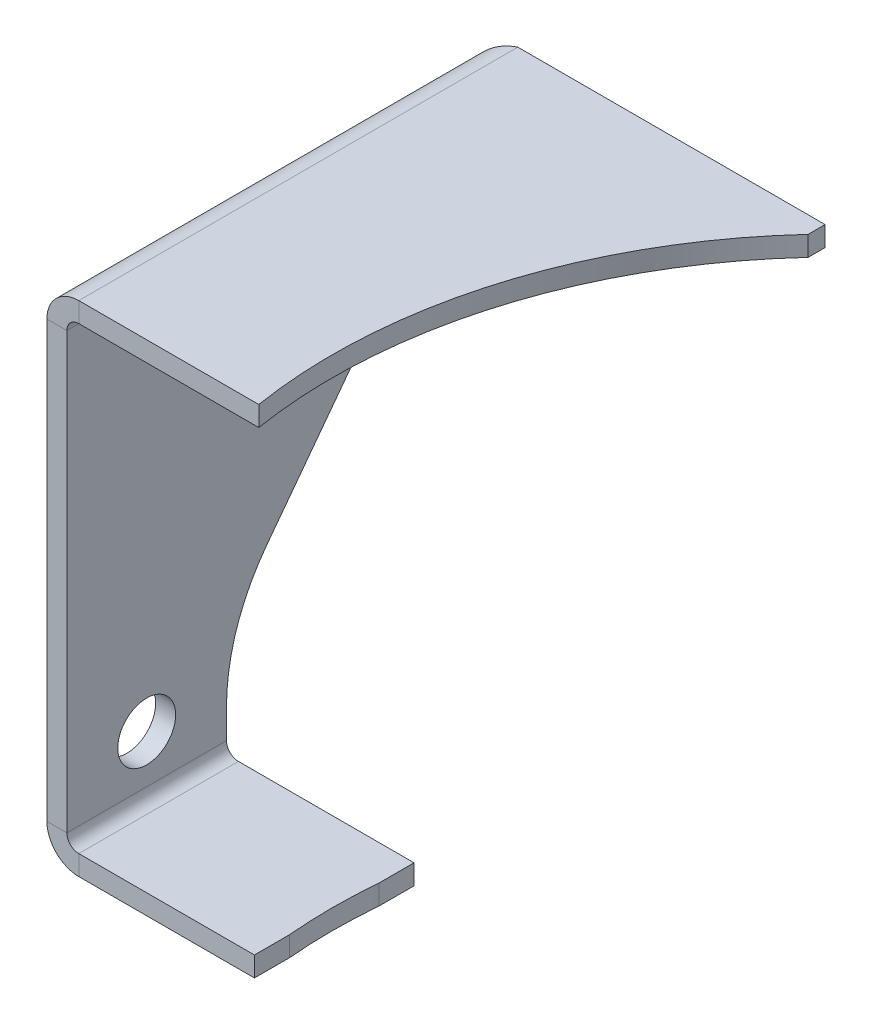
ISO-10303-21;
HEADER;
FILE_DESCRIPTION(('STEP AP214'),'2;1');
FILE_NAME('part.step','',(''),(''),'','','');
FILE_SCHEMA(('AUTOMOTIVE_DESIGN { 1 0 10303 214 1 1 1 1 }'));
ENDSEC;
DATA;
#1=APPLICATION_CONTEXT('core data for automotive mechanical design processes');
#2=APPLICATION_PROTOCOL_DEFINITION('international standard','automotive_design',2000,#1);
#3=PRODUCT_CONTEXT('',#1,'mechanical');
#4=PRODUCT('Part','Part','',(#3));
#5=PRODUCT_RELATED_PRODUCT_CATEGORY('part','',(#4));
#6=PRODUCT_DEFINITION_FORMATION('','',#4);
#7=PRODUCT_DEFINITION_CONTEXT('part definition',#1,'design');
#8=PRODUCT_DEFINITION('design','',#6,#7);
#9=PRODUCT_DEFINITION_SHAPE('','',#8);
#10=(LENGTH_UNIT() NAMED_UNIT(*) SI_UNIT(.MILLI.,.METRE.));
#11=(NAMED_UNIT(*) PLANE_ANGLE_UNIT() SI_UNIT($,.RADIAN.));
#12=(NAMED_UNIT(*) SI_UNIT($,.STERADIAN.) SOLID_ANGLE_UNIT());
#13=UNCERTAINTY_MEASURE_WITH_UNIT(LENGTH_MEASURE(1.E-05),#10,'distance_accuracy_value','');
#14=(GEOMETRIC_REPRESENTATION_CONTEXT(3) GLOBAL_UNCERTAINTY_ASSIGNED_CONTEXT((#13)) GLOBAL_UNIT_ASSIGNED_CONTEXT((#10,
#11,#12)) REPRESENTATION_CONTEXT('',''));
#15=CARTESIAN_POINT('',(0.,0.,0.));
#16=DIRECTION('',(0.,0.,1.));
#17=DIRECTION('',(1.,0.,0.));
#18=AXIS2_PLACEMENT_3D('',#15,#16,#17);
#19=CARTESIAN_POINT('',(0.,-20.,20.));
#20=DIRECTION('',(0.,1.,0.));
#21=DIRECTION('',(0.,0.,1.));
#22=AXIS2_PLACEMENT_3D('',#19,#20,#21);
#23=PLANE('',#22);
#24=CARTESIAN_POINT('',(178.,-20.,0.));
#25=DIRECTION('',(0.,1.,0.));
#26=DIRECTION('',(0.,0.,1.));
#27=AXIS2_PLACEMENT_3D('',#24,#25,#26);
#28=CIRCLE('',#27,126.5);
#29=CARTESIAN_POINT('',(52.,-20.,-11.236102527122));
#30=VERTEX_POINT('',#29);
#31=CARTESIAN_POINT('',(52.,-20.,11.236102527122));
#32=VERTEX_POINT('',#31);
#33=EDGE_CURVE('E183',#30,#32,#28,.T.);
#34=ORIENTED_EDGE('',*,*,#33,.T.);
#35=DIRECTION('',(0.,0.,-1.));
#36=VECTOR('',#35,1.);
#37=CARTESIAN_POINT('',(52.,-20.,20.));
#38=LINE('',#37,#36);
#39=CARTESIAN_POINT('',(52.,-20.,20.));
#40=VERTEX_POINT('',#39);
#41=EDGE_CURVE('E192',#40,#32,#38,.T.);
#42=ORIENTED_EDGE('',*,*,#41,.F.);
#43=DIRECTION('',(1.,0.,0.));
#44=VECTOR('',#43,1.);
#45=CARTESIAN_POINT('',(0.,-20.,20.));
#46=LINE('',#45,#44);
#47=CARTESIAN_POINT('',(8.,-20.,20.));
#48=VERTEX_POINT('',#47);
#49=EDGE_CURVE('E246',#48,#40,#46,.T.);
#50=ORIENTED_EDGE('',*,*,#49,.F.);
#51=DIRECTION('',(0.,0.,-1.));
#52=VECTOR('',#51,1.);
#53=CARTESIAN_POINT('',(8.,-20.,20.));
#54=LINE('',#53,#52);
#55=CARTESIAN_POINT('',(8.,-20.,-20.));
#56=VERTEX_POINT('',#55);
#57=EDGE_CURVE('E247',#48,#56,#54,.T.);
#58=ORIENTED_EDGE('',*,*,#57,.T.);
#59=DIRECTION('',(1.,0.,0.));
#60=VECTOR('',#59,1.);
#61=CARTESIAN_POINT('',(0.,-20.,-20.));
#62=LINE('',#61,#60);
#63=CARTESIAN_POINT('',(52.,-20.,-20.));
#64=VERTEX_POINT('',#63);
#65=EDGE_CURVE('E614',#56,#64,#62,.T.);
#66=ORIENTED_EDGE('',*,*,#65,.T.);
#67=EDGE_CURVE('E200',#30,#64,#38,.T.);
#68=ORIENTED_EDGE('',*,*,#67,.F.);
#69=EDGE_LOOP('',(#34,#42,#50,#58,#66,#68));
#70=FACE_BOUND('',#69,.T.);
#71=ADVANCED_FACE('F56',(#70),#23,.F.);
#72=CARTESIAN_POINT('',(52.,-15.,20.));
#73=DIRECTION('',(1.,0.,0.));
#74=DIRECTION('',(0.,0.,-1.));
#75=AXIS2_PLACEMENT_3D('',#72,#73,#74);
#76=PLANE('',#75);
#77=DIRECTION('',(0.,0.,-1.));
#78=VECTOR('',#77,1.);
#79=CARTESIAN_POINT('',(52.,-15.,20.));
#80=LINE('',#79,#78);
#81=CARTESIAN_POINT('',(52.,-15.,-11.236102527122));
#82=VERTEX_POINT('',#81);
#83=CARTESIAN_POINT('',(52.,-15.,-20.));
#84=VERTEX_POINT('',#83);
#85=EDGE_CURVE('E201',#82,#84,#80,.T.);
#86=ORIENTED_EDGE('',*,*,#85,.F.);
#87=DIRECTION('',(0.,-1.,0.));
#88=VECTOR('',#87,1.);
#89=CARTESIAN_POINT('',(52.,-20.,-11.236102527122));
#90=LINE('',#89,#88);
#91=EDGE_CURVE('E179',#30,#82,#90,.F.);
#92=ORIENTED_EDGE('',*,*,#91,.F.);
#93=ORIENTED_EDGE('',*,*,#67,.T.);
#94=DIRECTION('',(0.,-1.,0.));
#95=VECTOR('',#94,1.);
#96=CARTESIAN_POINT('',(52.,-15.,-20.));
#97=LINE('',#96,#95);
#98=EDGE_CURVE('E264',#84,#64,#97,.T.);
#99=ORIENTED_EDGE('',*,*,#98,.F.);
#100=EDGE_LOOP('',(#86,#92,#93,#99));
#101=FACE_BOUND('',#100,.T.);
#102=ADVANCED_FACE('F287',(#101),#76,.T.);
#103=ORIENTED_EDGE('',*,*,#41,.T.);
#104=DIRECTION('',(0.,-1.,0.));
#105=VECTOR('',#104,1.);
#106=CARTESIAN_POINT('',(52.,-20.,11.236102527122));
#107=LINE('',#106,#105);
#108=CARTESIAN_POINT('',(52.,-15.,11.236102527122));
#109=VERTEX_POINT('',#108);
#110=EDGE_CURVE('E176',#32,#109,#107,.F.);
#111=ORIENTED_EDGE('',*,*,#110,.T.);
#112=CARTESIAN_POINT('',(52.,-15.,20.));
#113=VERTEX_POINT('',#112);
#114=EDGE_CURVE('E189',#113,#109,#80,.T.);
#115=ORIENTED_EDGE('',*,*,#114,.F.);
#116=DIRECTION('',(0.,-1.,0.));
#117=VECTOR('',#116,1.);
#118=CARTESIAN_POINT('',(52.,-15.,20.));
#119=LINE('',#118,#117);
#120=EDGE_CURVE('E616',#113,#40,#119,.T.);
#121=ORIENTED_EDGE('',*,*,#120,.T.);
#122=EDGE_LOOP('',(#103,#111,#115,#121));
#123=FACE_BOUND('',#122,.T.);
#124=ADVANCED_FACE('F187',(#123),#76,.T.);
#125=CARTESIAN_POINT('',(0.,-15.,20.));
#126=DIRECTION('',(0.,1.,0.));
#127=DIRECTION('',(0.,0.,1.));
#128=AXIS2_PLACEMENT_3D('',#125,#126,#127);
#129=PLANE('',#128);
#130=ORIENTED_EDGE('',*,*,#114,.T.);
#131=CARTESIAN_POINT('',(178.,-15.,0.));
#132=DIRECTION('',(0.,1.,0.));
#133=DIRECTION('',(0.,0.,1.));
#134=AXIS2_PLACEMENT_3D('',#131,#132,#133);
#135=CIRCLE('',#134,126.5);
#136=EDGE_CURVE('E173',#82,#109,#135,.T.);
#137=ORIENTED_EDGE('',*,*,#136,.F.);
#138=ORIENTED_EDGE('',*,*,#85,.T.);
#139=DIRECTION('',(1.,0.,0.));
#140=VECTOR('',#139,1.);
#141=CARTESIAN_POINT('',(0.,-15.,-20.));
#142=LINE('',#141,#140);
#143=CARTESIAN_POINT('',(8.,-15.,-20.));
#144=VERTEX_POINT('',#143);
#145=EDGE_CURVE('E240',#144,#84,#142,.T.);
#146=ORIENTED_EDGE('',*,*,#145,.F.);
#147=DIRECTION('',(0.,0.,-1.));
#148=VECTOR('',#147,1.);
#149=CARTESIAN_POINT('',(8.,-15.,20.));
#150=LINE('',#149,#148);
#151=CARTESIAN_POINT('',(8.,-15.,20.));
#152=VERTEX_POINT('',#151);
#153=EDGE_CURVE('E204',#152,#144,#150,.T.);
#154=ORIENTED_EDGE('',*,*,#153,.F.);
#155=DIRECTION('',(1.,0.,0.));
#156=VECTOR('',#155,1.);
#157=CARTESIAN_POINT('',(0.,-15.,20.));
#158=LINE('',#157,#156);
#159=EDGE_CURVE('E199',#152,#113,#158,.T.);
#160=ORIENTED_EDGE('',*,*,#159,.T.);
#161=EDGE_LOOP('',(#130,#137,#138,#146,#154,#160));
#162=FACE_BOUND('',#161,.T.);
#163=ADVANCED_FACE('F196',(#162),#129,.T.);
#164=CARTESIAN_POINT('',(4.99999999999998,105.,20.));
#165=DIRECTION('',(0.,0.,1.));
#166=DIRECTION('',(1.,0.,0.));
#167=AXIS2_PLACEMENT_3D('',#164,#165,#166);
#168=PLANE('',#167);
#169=DIRECTION('',(1.,0.,0.));
#170=VECTOR('',#169,1.);
#171=CARTESIAN_POINT('',(5.,100.,20.));
#172=LINE('',#171,#170);
#173=CARTESIAN_POINT('',(53.0910331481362,100.,20.));
#174=VERTEX_POINT('',#173);
#175=CARTESIAN_POINT('',(7.99999999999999,100.,20.));
#176=VERTEX_POINT('',#175);
#177=EDGE_CURVE('E679',#174,#176,#172,.F.);
#178=ORIENTED_EDGE('',*,*,#177,.F.);
#179=DIRECTION('',(0.,1.,0.));
#180=VECTOR('',#179,1.);
#181=CARTESIAN_POINT('',(53.0910331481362,105.,20.));
#182=LINE('',#181,#180);
#183=CARTESIAN_POINT('',(53.0910331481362,105.,20.));
#184=VERTEX_POINT('',#183);
#185=EDGE_CURVE('E660',#184,#174,#182,.F.);
#186=ORIENTED_EDGE('',*,*,#185,.F.);
#187=DIRECTION('',(-1.,0.,0.));
#188=VECTOR('',#187,1.);
#189=CARTESIAN_POINT('',(4.99999999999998,105.,20.));
#190=LINE('',#189,#188);
#191=CARTESIAN_POINT('',(7.99999999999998,105.,20.));
#192=VERTEX_POINT('',#191);
#193=EDGE_CURVE('E673',#184,#192,#190,.T.);
#194=ORIENTED_EDGE('',*,*,#193,.T.);
#195=DIRECTION('',(0.,1.,0.));
#196=VECTOR('',#195,1.);
#197=CARTESIAN_POINT('',(7.99999999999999,100.,20.));
#198=LINE('',#197,#196);
#199=EDGE_CURVE('E642',#176,#192,#198,.T.);
#200=ORIENTED_EDGE('',*,*,#199,.F.);
#201=EDGE_LOOP('',(#178,#186,#194,#200));
#202=FACE_BOUND('',#201,.T.);
#203=ADVANCED_FACE('F327',(#202),#168,.T.);
#204=CARTESIAN_POINT('',(4.99999999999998,105.,20.));
#205=DIRECTION('',(0.,1.,0.));
#206=DIRECTION('',(-1.,0.,0.));
#207=AXIS2_PLACEMENT_3D('',#204,#205,#206);
#208=PLANE('',#207);
#209=ORIENTED_EDGE('',*,*,#193,.F.);
#210=CARTESIAN_POINT('',(178.,105.000000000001,0.));
#211=DIRECTION('',(0.,1.,0.));
#212=DIRECTION('',(-1.,0.,0.));
#213=AXIS2_PLACEMENT_3D('',#210,#211,#212);
#214=CIRCLE('',#213,126.5);
#215=CARTESIAN_POINT('',(85.,105.,-85.7510932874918));
#216=VERTEX_POINT('',#215);
#217=EDGE_CURVE('E193',#216,#184,#214,.T.);
#218=ORIENTED_EDGE('',*,*,#217,.F.);
#219=DIRECTION('',(0.,0.,1.));
#220=VECTOR('',#219,1.);
#221=CARTESIAN_POINT('',(85.,105.,20.));
#222=LINE('',#221,#220);
#223=CARTESIAN_POINT('',(85.,105.,-90.));
#224=VERTEX_POINT('',#223);
#225=EDGE_CURVE('E675',#224,#216,#222,.T.);
#226=ORIENTED_EDGE('',*,*,#225,.F.);
#227=DIRECTION('',(1.,0.,0.));
#228=VECTOR('',#227,1.);
#229=CARTESIAN_POINT('',(85.,105.,-90.));
#230=LINE('',#229,#228);
#231=CARTESIAN_POINT('',(7.99999999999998,105.,-90.));
#232=VERTEX_POINT('',#231);
#233=EDGE_CURVE('E677',#232,#224,#230,.T.);
#234=ORIENTED_EDGE('',*,*,#233,.F.);
#235=DIRECTION('',(0.,0.,1.));
#236=VECTOR('',#235,1.);
#237=CARTESIAN_POINT('',(7.99999999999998,105.,20.));
#238=LINE('',#237,#236);
#239=EDGE_CURVE('E686',#232,#192,#238,.T.);
#240=ORIENTED_EDGE('',*,*,#239,.T.);
#241=EDGE_LOOP('',(#209,#218,#226,#234,#240));
#242=FACE_BOUND('',#241,.T.);
#243=ADVANCED_FACE('F332',(#242),#208,.T.);
#244=CARTESIAN_POINT('',(5.,100.,20.));
#245=DIRECTION('',(0.,1.,0.));
#246=DIRECTION('',(-1.,0.,0.));
#247=AXIS2_PLACEMENT_3D('',#244,#245,#246);
#248=PLANE('',#247);
#249=CARTESIAN_POINT('',(178.,100.000000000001,0.));
#250=DIRECTION('',(0.,1.,0.));
#251=DIRECTION('',(-1.,0.,0.));
#252=AXIS2_PLACEMENT_3D('',#249,#250,#251);
#253=CIRCLE('',#252,126.5);
#254=CARTESIAN_POINT('',(85.,100.,-85.7510932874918));
#255=VERTEX_POINT('',#254);
#256=EDGE_CURVE('E666',#255,#174,#253,.T.);
#257=ORIENTED_EDGE('',*,*,#256,.T.);
#258=ORIENTED_EDGE('',*,*,#177,.T.);
#259=DIRECTION('',(0.,0.,-1.));
#260=VECTOR('',#259,1.);
#261=CARTESIAN_POINT('',(7.99999999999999,100.,-90.));
#262=LINE('',#261,#260);
#263=CARTESIAN_POINT('',(7.99999999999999,100.,-90.));
#264=VERTEX_POINT('',#263);
#265=EDGE_CURVE('E659',#264,#176,#262,.F.);
#266=ORIENTED_EDGE('',*,*,#265,.F.);
#267=DIRECTION('',(-1.,0.,0.));
#268=VECTOR('',#267,1.);
#269=CARTESIAN_POINT('',(5.,100.,-90.));
#270=LINE('',#269,#268);
#271=CARTESIAN_POINT('',(85.,100.,-90.));
#272=VERTEX_POINT('',#271);
#273=EDGE_CURVE('E684',#264,#272,#270,.F.);
#274=ORIENTED_EDGE('',*,*,#273,.T.);
#275=DIRECTION('',(0.,0.,-1.));
#276=VECTOR('',#275,1.);
#277=CARTESIAN_POINT('',(85.,100.,20.));
#278=LINE('',#277,#276);
#279=EDGE_CURVE('E681',#272,#255,#278,.F.);
#280=ORIENTED_EDGE('',*,*,#279,.T.);
#281=EDGE_LOOP('',(#257,#258,#266,#274,#280));
#282=FACE_BOUND('',#281,.T.);
#283=ADVANCED_FACE('F538',(#282),#248,.F.);
#284=CARTESIAN_POINT('',(85.,105.,20.));
#285=DIRECTION('',(1.,0.,0.));
#286=DIRECTION('',(0.,1.,0.));
#287=AXIS2_PLACEMENT_3D('',#284,#285,#286);
#288=PLANE('',#287);
#289=ORIENTED_EDGE('',*,*,#225,.T.);
#290=DIRECTION('',(0.,1.,0.));
#291=VECTOR('',#290,1.);
#292=CARTESIAN_POINT('',(85.,105.,-85.7510932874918));
#293=LINE('',#292,#291);
#294=EDGE_CURVE('E661',#216,#255,#293,.F.);
#295=ORIENTED_EDGE('',*,*,#294,.T.);
#296=ORIENTED_EDGE('',*,*,#279,.F.);
#297=DIRECTION('',(0.,-1.,0.));
#298=VECTOR('',#297,1.);
#299=CARTESIAN_POINT('',(85.,105.,-90.));
#300=LINE('',#299,#298);
#301=EDGE_CURVE('E651',#224,#272,#300,.T.);
#302=ORIENTED_EDGE('',*,*,#301,.F.);
#303=EDGE_LOOP('',(#289,#295,#296,#302));
#304=FACE_BOUND('',#303,.T.);
#305=ADVANCED_FACE('F306',(#304),#288,.T.);
#306=CARTESIAN_POINT('',(8.,-15.,20.));
#307=DIRECTION('',(0.,0.,1.));
#308=DIRECTION('',(1.,0.,0.));
#309=AXIS2_PLACEMENT_3D('',#306,#307,#308);
#310=PLANE('',#309);
#311=DIRECTION('',(0.,1.,0.));
#312=VECTOR('',#311,1.);
#313=CARTESIAN_POINT('',(5.00000000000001,20.,20.));
#314=LINE('',#313,#312);
#315=CARTESIAN_POINT('',(5.00000000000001,97.,20.));
#316=VERTEX_POINT('',#315);
#317=CARTESIAN_POINT('',(5.,-12.,20.));
#318=VERTEX_POINT('',#317);
#319=EDGE_CURVE('E620',#316,#318,#314,.F.);
#320=ORIENTED_EDGE('',*,*,#319,.F.);
#321=DIRECTION('',(-1.,0.,0.));
#322=VECTOR('',#321,1.);
#323=CARTESIAN_POINT('',(5.00000000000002,97.,20.));
#324=LINE('',#323,#322);
#325=CARTESIAN_POINT('',(0.,97.,20.));
#326=VERTEX_POINT('',#325);
#327=EDGE_CURVE('E583',#316,#326,#324,.T.);
#328=ORIENTED_EDGE('',*,*,#327,.T.);
#329=DIRECTION('',(0.,-1.,0.));
#330=VECTOR('',#329,1.);
#331=CARTESIAN_POINT('',(0.,20.,20.));
#332=LINE('',#331,#330);
#333=CARTESIAN_POINT('',(0.,-12.,20.));
#334=VERTEX_POINT('',#333);
#335=EDGE_CURVE('E277',#326,#334,#332,.T.);
#336=ORIENTED_EDGE('',*,*,#335,.T.);
#337=DIRECTION('',(1.,0.,0.));
#338=VECTOR('',#337,1.);
#339=CARTESIAN_POINT('',(0.,-12.,20.));
#340=LINE('',#339,#338);
#341=EDGE_CURVE('E215',#334,#318,#340,.T.);
#342=ORIENTED_EDGE('',*,*,#341,.T.);
#343=EDGE_LOOP('',(#320,#328,#336,#342));
#344=FACE_BOUND('',#343,.T.);
#345=ADVANCED_FACE('F303',(#344),#310,.T.);
#346=CARTESIAN_POINT('',(5.00000000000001,20.,20.));
#347=DIRECTION('',(1.,0.,0.));
#348=DIRECTION('',(0.,0.,-1.));
#349=AXIS2_PLACEMENT_3D('',#346,#347,#348);
#350=PLANE('',#349);
#351=CARTESIAN_POINT('',(5.,0.,0.));
#352=DIRECTION('',(1.,0.,0.));
#353=DIRECTION('',(0.,0.,-1.));
#354=AXIS2_PLACEMENT_3D('',#351,#352,#353);
#355=CIRCLE('',#354,7.25);
#356=CARTESIAN_POINT('',(5.,0.,-7.25));
#357=VERTEX_POINT('',#356);
#358=EDGE_CURVE('E611',#357,#357,#355,.T.);
#359=ORIENTED_EDGE('',*,*,#358,.F.);
#360=EDGE_LOOP('',(#359));
#361=FACE_BOUND('',#360,.T.);
#362=DIRECTION('',(0.,-0.798967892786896,0.601373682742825));
#363=VECTOR('',#362,1.);
#364=CARTESIAN_POINT('',(5.,12.,-20.));
#365=LINE('',#364,#363);
#366=CARTESIAN_POINT('',(5.,97.,-83.9784946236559));
#367=VERTEX_POINT('',#366);
#368=CARTESIAN_POINT('',(5.,25.3542756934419,-30.0516053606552));
#369=VERTEX_POINT('',#368);
#370=EDGE_CURVE('E605',#367,#369,#365,.T.);
#371=ORIENTED_EDGE('',*,*,#370,.F.);
#372=DIRECTION('',(0.,0.,1.));
#373=VECTOR('',#372,1.);
#374=CARTESIAN_POINT('',(5.00000000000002,97.,20.));
#375=LINE('',#374,#373);
#376=EDGE_CURVE('E604',#316,#367,#375,.F.);
#377=ORIENTED_EDGE('',*,*,#376,.F.);
#378=ORIENTED_EDGE('',*,*,#319,.T.);
#379=DIRECTION('',(0.,0.,-1.));
#380=VECTOR('',#379,1.);
#381=CARTESIAN_POINT('',(5.,-12.,20.));
#382=LINE('',#381,#380);
#383=CARTESIAN_POINT('',(5.,-12.,-20.));
#384=VERTEX_POINT('',#383);
#385=EDGE_CURVE('E233',#318,#384,#382,.T.);
#386=ORIENTED_EDGE('',*,*,#385,.T.);
#387=DIRECTION('',(0.,1.,0.));
#388=VECTOR('',#387,1.);
#389=CARTESIAN_POINT('',(5.00000000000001,20.,-20.));
#390=LINE('',#389,#388);
#391=CARTESIAN_POINT('',(5.00000000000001,-4.7144084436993,-20.));
#392=VERTEX_POINT('',#391);
#393=EDGE_CURVE('E225',#392,#384,#390,.F.);
#394=ORIENTED_EDGE('',*,*,#393,.F.);
#395=CARTESIAN_POINT('',(5.00000000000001,-4.7144084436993,-70.));
#396=DIRECTION('',(1.,0.,0.));
#397=DIRECTION('',(0.,0.,-1.));
#398=AXIS2_PLACEMENT_3D('',#395,#396,#397);
#399=CIRCLE('',#398,50.);
#400=EDGE_CURVE('E64',#392,#369,#399,.F.);
#401=ORIENTED_EDGE('',*,*,#400,.T.);
#402=EDGE_LOOP('',(#371,#377,#378,#386,#394,#401));
#403=FACE_BOUND('',#402,.T.);
#404=ADVANCED_FACE('F231',(#361,#403),#350,.T.);
#405=CARTESIAN_POINT('',(0.,20.,20.));
#406=DIRECTION('',(1.,0.,0.));
#407=DIRECTION('',(0.,0.,-1.));
#408=AXIS2_PLACEMENT_3D('',#405,#406,#407);
#409=PLANE('',#408);
#410=CARTESIAN_POINT('',(0.,0.,0.));
#411=DIRECTION('',(-1.,0.,0.));
#412=DIRECTION('',(0.,0.,1.));
#413=AXIS2_PLACEMENT_3D('',#410,#411,#412);
#414=CIRCLE('',#413,7.25);
#415=CARTESIAN_POINT('',(0.,0.,7.25));
#416=VERTEX_POINT('',#415);
#417=EDGE_CURVE('E607',#416,#416,#414,.T.);
#418=ORIENTED_EDGE('',*,*,#417,.F.);
#419=EDGE_LOOP('',(#418));
#420=FACE_BOUND('',#419,.T.);
#421=DIRECTION('',(0.,0.,1.));
#422=VECTOR('',#421,1.);
#423=CARTESIAN_POINT('',(0.,97.,20.));
#424=LINE('',#423,#422);
#425=CARTESIAN_POINT('',(0.,97.,-83.9784946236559));
#426=VERTEX_POINT('',#425);
#427=EDGE_CURVE('E584',#326,#426,#424,.F.);
#428=ORIENTED_EDGE('',*,*,#427,.T.);
#429=DIRECTION('',(0.,-0.798967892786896,0.601373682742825));
#430=VECTOR('',#429,1.);
#431=CARTESIAN_POINT('',(0.,12.,-20.));
#432=LINE('',#431,#430);
#433=CARTESIAN_POINT('',(0.,25.3542756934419,-30.0516053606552));
#434=VERTEX_POINT('',#433);
#435=EDGE_CURVE('E279',#426,#434,#432,.T.);
#436=ORIENTED_EDGE('',*,*,#435,.T.);
#437=CARTESIAN_POINT('',(0.,-4.7144084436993,-70.));
#438=DIRECTION('',(1.,0.,0.));
#439=DIRECTION('',(0.,0.,-1.));
#440=AXIS2_PLACEMENT_3D('',#437,#438,#439);
#441=CIRCLE('',#440,50.);
#442=CARTESIAN_POINT('',(0.,-4.7144084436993,-20.));
#443=VERTEX_POINT('',#442);
#444=EDGE_CURVE('E13',#434,#443,#441,.T.);
#445=ORIENTED_EDGE('',*,*,#444,.T.);
#446=DIRECTION('',(0.,-1.,0.));
#447=VECTOR('',#446,1.);
#448=CARTESIAN_POINT('',(0.,20.,-20.));
#449=LINE('',#448,#447);
#450=CARTESIAN_POINT('',(0.,-12.,-20.));
#451=VERTEX_POINT('',#450);
#452=EDGE_CURVE('E227',#443,#451,#449,.T.);
#453=ORIENTED_EDGE('',*,*,#452,.T.);
#454=DIRECTION('',(0.,0.,-1.));
#455=VECTOR('',#454,1.);
#456=CARTESIAN_POINT('',(0.,-12.,20.));
#457=LINE('',#456,#455);
#458=EDGE_CURVE('E250',#334,#451,#457,.T.);
#459=ORIENTED_EDGE('',*,*,#458,.F.);
#460=ORIENTED_EDGE('',*,*,#335,.F.);
#461=EDGE_LOOP('',(#428,#436,#445,#453,#459,#460));
#462=FACE_BOUND('',#461,.T.);
#463=ADVANCED_FACE('F276',(#420,#462),#409,.F.);
#464=CARTESIAN_POINT('',(8.00000000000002,15.,-20.));
#465=DIRECTION('',(0.,0.,-1.));
#466=DIRECTION('',(-1.,0.,0.));
#467=AXIS2_PLACEMENT_3D('',#464,#465,#466);
#468=PLANE('',#467);
#469=ORIENTED_EDGE('',*,*,#452,.F.);
#470=DIRECTION('',(1.,0.,0.));
#471=VECTOR('',#470,1.);
#472=CARTESIAN_POINT('',(5.,-4.7144084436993,-20.));
#473=LINE('',#472,#471);
#474=EDGE_CURVE('E218',#443,#392,#473,.T.);
#475=ORIENTED_EDGE('',*,*,#474,.T.);
#476=ORIENTED_EDGE('',*,*,#393,.T.);
#477=DIRECTION('',(-1.,0.,0.));
#478=VECTOR('',#477,1.);
#479=CARTESIAN_POINT('',(5.,-12.,-20.));
#480=LINE('',#479,#478);
#481=EDGE_CURVE('E208',#384,#451,#480,.T.);
#482=ORIENTED_EDGE('',*,*,#481,.T.);
#483=EDGE_LOOP('',(#469,#475,#476,#482));
#484=FACE_BOUND('',#483,.T.);
#485=ADVANCED_FACE('F224',(#484),#468,.T.);
#486=CARTESIAN_POINT('',(0.,-12.,20.));
#487=DIRECTION('',(0.,0.,1.));
#488=DIRECTION('',(1.,0.,0.));
#489=AXIS2_PLACEMENT_3D('',#486,#487,#488);
#490=PLANE('',#489);
#491=ORIENTED_EDGE('',*,*,#341,.F.);
#492=CARTESIAN_POINT('',(8.,-12.,20.));
#493=DIRECTION('',(0.,0.,-1.));
#494=DIRECTION('',(-1.,0.,0.));
#495=AXIS2_PLACEMENT_3D('',#492,#493,#494);
#496=CIRCLE('',#495,8.);
#497=EDGE_CURVE('E251',#334,#48,#496,.F.);
#498=ORIENTED_EDGE('',*,*,#497,.T.);
#499=DIRECTION('',(0.,-1.,0.));
#500=VECTOR('',#499,1.);
#501=CARTESIAN_POINT('',(8.,-15.,20.));
#502=LINE('',#501,#500);
#503=EDGE_CURVE('E213',#152,#48,#502,.T.);
#504=ORIENTED_EDGE('',*,*,#503,.F.);
#505=CARTESIAN_POINT('',(8.,-12.,20.));
#506=DIRECTION('',(0.,0.,1.));
#507=DIRECTION('',(1.,0.,0.));
#508=AXIS2_PLACEMENT_3D('',#505,#506,#507);
#509=CIRCLE('',#508,3.);
#510=EDGE_CURVE('E259',#318,#152,#509,.T.);
#511=ORIENTED_EDGE('',*,*,#510,.F.);
#512=EDGE_LOOP('',(#491,#498,#504,#511));
#513=FACE_BOUND('',#512,.T.);
#514=ADVANCED_FACE('F302',(#513),#490,.T.);
#515=CARTESIAN_POINT('',(8.,-20.,-20.));
#516=DIRECTION('',(0.,0.,-1.));
#517=DIRECTION('',(-1.,0.,0.));
#518=AXIS2_PLACEMENT_3D('',#515,#516,#517);
#519=PLANE('',#518);
#520=DIRECTION('',(0.,1.,0.));
#521=VECTOR('',#520,1.);
#522=CARTESIAN_POINT('',(8.,-20.,-20.));
#523=LINE('',#522,#521);
#524=EDGE_CURVE('E211',#56,#144,#523,.T.);
#525=ORIENTED_EDGE('',*,*,#524,.F.);
#526=CARTESIAN_POINT('',(8.,-12.,-20.));
#527=DIRECTION('',(0.,0.,-1.));
#528=DIRECTION('',(-1.,0.,0.));
#529=AXIS2_PLACEMENT_3D('',#526,#527,#528);
#530=CIRCLE('',#529,8.);
#531=EDGE_CURVE('E237',#451,#56,#530,.F.);
#532=ORIENTED_EDGE('',*,*,#531,.F.);
#533=ORIENTED_EDGE('',*,*,#481,.F.);
#534=CARTESIAN_POINT('',(8.,-12.,-20.));
#535=DIRECTION('',(0.,0.,1.));
#536=DIRECTION('',(1.,0.,0.));
#537=AXIS2_PLACEMENT_3D('',#534,#535,#536);
#538=CIRCLE('',#537,3.);
#539=EDGE_CURVE('E235',#384,#144,#538,.T.);
#540=ORIENTED_EDGE('',*,*,#539,.T.);
#541=EDGE_LOOP('',(#525,#532,#533,#540));
#542=FACE_BOUND('',#541,.T.);
#543=ADVANCED_FACE('F266',(#542),#519,.T.);
#544=CARTESIAN_POINT('',(5.,-12.,-20.));
#545=DIRECTION('',(0.,0.,-1.));
#546=DIRECTION('',(-1.,0.,0.));
#547=AXIS2_PLACEMENT_3D('',#544,#545,#546);
#548=PLANE('',#547);
#549=ORIENTED_EDGE('',*,*,#65,.F.);
#550=ORIENTED_EDGE('',*,*,#524,.T.);
#551=ORIENTED_EDGE('',*,*,#145,.T.);
#552=ORIENTED_EDGE('',*,*,#98,.T.);
#553=EDGE_LOOP('',(#549,#550,#551,#552));
#554=FACE_BOUND('',#553,.T.);
#555=ADVANCED_FACE('F297',(#554),#548,.T.);
#556=CARTESIAN_POINT('',(8.,-12.,20.));
#557=DIRECTION('',(0.,0.,-1.));
#558=DIRECTION('',(-1.,0.,0.));
#559=AXIS2_PLACEMENT_3D('',#556,#557,#558);
#560=CYLINDRICAL_SURFACE('',#559,3.);
#561=ORIENTED_EDGE('',*,*,#539,.F.);
#562=ORIENTED_EDGE('',*,*,#385,.F.);
#563=ORIENTED_EDGE('',*,*,#510,.T.);
#564=ORIENTED_EDGE('',*,*,#153,.T.);
#565=EDGE_LOOP('',(#561,#562,#563,#564));
#566=FACE_BOUND('',#565,.T.);
#567=ADVANCED_FACE('F257',(#566),#560,.F.);
#568=CARTESIAN_POINT('',(8.,-12.,20.));
#569=DIRECTION('',(0.,0.,-1.));
#570=DIRECTION('',(-1.,0.,0.));
#571=AXIS2_PLACEMENT_3D('',#568,#569,#570);
#572=CYLINDRICAL_SURFACE('',#571,8.);
#573=ORIENTED_EDGE('',*,*,#531,.T.);
#574=ORIENTED_EDGE('',*,*,#57,.F.);
#575=ORIENTED_EDGE('',*,*,#497,.F.);
#576=ORIENTED_EDGE('',*,*,#458,.T.);
#577=EDGE_LOOP('',(#573,#574,#575,#576));
#578=FACE_BOUND('',#577,.T.);
#579=ADVANCED_FACE('F271',(#578),#572,.T.);
#580=CARTESIAN_POINT('',(8.,-12.,20.));
#581=DIRECTION('',(0.,0.,1.));
#582=DIRECTION('',(1.,0.,0.));
#583=AXIS2_PLACEMENT_3D('',#580,#581,#582);
#584=PLANE('',#583);
#585=ORIENTED_EDGE('',*,*,#49,.T.);
#586=ORIENTED_EDGE('',*,*,#120,.F.);
#587=ORIENTED_EDGE('',*,*,#159,.F.);
#588=ORIENTED_EDGE('',*,*,#503,.T.);
#589=EDGE_LOOP('',(#585,#586,#587,#588));
#590=FACE_BOUND('',#589,.T.);
#591=ADVANCED_FACE('F423',(#590),#584,.T.);
#592=CARTESIAN_POINT('',(79.4,0.,0.));
#593=DIRECTION('',(-1.,0.,0.));
#594=DIRECTION('',(0.,0.,1.));
#595=AXIS2_PLACEMENT_3D('',#592,#593,#594);
#596=CYLINDRICAL_SURFACE('',#595,7.25);
#597=ORIENTED_EDGE('',*,*,#358,.T.);
#598=EDGE_LOOP('',(#597));
#599=FACE_BOUND('',#598,.T.);
#600=ORIENTED_EDGE('',*,*,#417,.T.);
#601=EDGE_LOOP('',(#600));
#602=FACE_BOUND('',#601,.T.);
#603=ADVANCED_FACE('F418',(#599,#602),#596,.F.);
#604=CARTESIAN_POINT('',(5.,12.,-20.));
#605=DIRECTION('',(0.,-0.601373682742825,-0.798967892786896));
#606=DIRECTION('',(0.,0.798967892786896,-0.601373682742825));
#607=AXIS2_PLACEMENT_3D('',#604,#605,#606);
#608=PLANE('',#607);
#609=ORIENTED_EDGE('',*,*,#370,.T.);
#610=DIRECTION('',(1.,0.,0.));
#611=VECTOR('',#610,1.);
#612=CARTESIAN_POINT('',(0.,25.3542756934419,-30.0516053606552));
#613=LINE('',#612,#611);
#614=EDGE_CURVE('E71',#369,#434,#613,.F.);
#615=ORIENTED_EDGE('',*,*,#614,.T.);
#616=ORIENTED_EDGE('',*,*,#435,.F.);
#617=DIRECTION('',(-1.,0.,0.));
#618=VECTOR('',#617,1.);
#619=CARTESIAN_POINT('',(5.00000000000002,97.,-83.9784946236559));
#620=LINE('',#619,#618);
#621=EDGE_CURVE('E585',#367,#426,#620,.T.);
#622=ORIENTED_EDGE('',*,*,#621,.F.);
#623=EDGE_LOOP('',(#609,#615,#616,#622));
#624=FACE_BOUND('',#623,.T.);
#625=ADVANCED_FACE('F402',(#624),#608,.T.);
#626=CARTESIAN_POINT('',(-0.0499999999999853,97.,-83.9784946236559));
#627=CARTESIAN_POINT('',(-0.0499999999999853,98.0538973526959,-84.4803607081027));
#628=CARTESIAN_POINT('',(0.159519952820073,99.1070704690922,-84.9820788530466));
#629=CARTESIAN_POINT('',(0.966019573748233,101.054132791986,-85.9856630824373));
#630=CARTESIAN_POINT('',(1.56268191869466,101.947101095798,-86.4874551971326));
#631=CARTESIAN_POINT('',(3.05289890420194,103.437318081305,-87.4910394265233));
#632=CARTESIAN_POINT('',(3.94586720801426,104.033980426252,-87.9928315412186));
#633=CARTESIAN_POINT('',(5.89292953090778,104.84048004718,-88.9964157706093));
#634=CARTESIAN_POINT('',(6.94610264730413,105.05,-89.4981339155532));
#635=CARTESIAN_POINT('',(7.99999999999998,105.05,-90.));
#636=CARTESIAN_POINT('',(0.,97.,-83.9784946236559));
#637=CARTESIAN_POINT('',(0.,98.0473511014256,-84.4803603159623));
#638=CARTESIAN_POINT('',(0.208218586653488,99.0939830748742,-84.9820788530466));
#639=CARTESIAN_POINT('',(1.00970889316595,101.028951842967,-85.9856630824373));
#640=CARTESIAN_POINT('',(1.60266526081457,101.916373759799,-86.4874551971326));
#641=CARTESIAN_POINT('',(3.08362624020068,103.397334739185,-87.4910394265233));
#642=CARTESIAN_POINT('',(3.9710481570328,103.990291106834,-87.9928315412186));
#643=CARTESIAN_POINT('',(5.90601692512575,104.791781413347,-88.9964157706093));
#644=CARTESIAN_POINT('',(6.95264889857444,105.,-89.4981343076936));
#645=CARTESIAN_POINT('',(7.99999999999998,105.,-90.));
#646=CARTESIAN_POINT('',(5.00000000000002,97.,-83.9784946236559));
#647=CARTESIAN_POINT('',(5.00000000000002,97.392725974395,-84.4803211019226));
#648=CARTESIAN_POINT('',(5.07808196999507,97.7852436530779,-84.9820788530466));
#649=CARTESIAN_POINT('',(5.37864083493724,98.5108569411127,-85.9856630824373));
#650=CARTESIAN_POINT('',(5.60099947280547,98.8436401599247,-86.4874551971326));
#651=CARTESIAN_POINT('',(6.15635984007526,99.3990005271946,-87.4910394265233));
#652=CARTESIAN_POINT('',(6.48914305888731,99.6213591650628,-87.9928315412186));
#653=CARTESIAN_POINT('',(7.21475634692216,99.921918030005,-88.9964157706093));
#654=CARTESIAN_POINT('',(7.60727402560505,100.,-89.4981735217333));
#655=CARTESIAN_POINT('',(8.,100.,-90.));
#656=CARTESIAN_POINT('',(5.05050000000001,97.,-83.9784946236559));
#657=CARTESIAN_POINT('',(5.05050000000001,97.386114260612,-84.4803207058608));
#658=CARTESIAN_POINT('',(5.12726759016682,97.7720253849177,-84.9820788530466));
#659=CARTESIAN_POINT('',(5.42276704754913,98.485424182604,-85.9856630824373));
#660=CARTESIAN_POINT('',(5.64138264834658,98.812605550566,-86.4874551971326));
#661=CARTESIAN_POINT('',(6.187394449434,99.3586173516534,-87.4910394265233));
#662=CARTESIAN_POINT('',(6.51457581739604,99.5772329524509,-87.9928315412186));
#663=CARTESIAN_POINT('',(7.2279746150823,99.8727324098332,-88.9964157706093));
#664=CARTESIAN_POINT('',(7.61388573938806,99.9495,-89.4981739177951));
#665=CARTESIAN_POINT('',(8.,99.9495,-90.));
#666=B_SPLINE_SURFACE_WITH_KNOTS('',1,3,((#626,#627,#628,#629,#630,#631,#632,#633,#634,#635),
(#636,#637,#638,#639,#640,#641,#642,#643,#644,#645),(#646,#647,#648,#649,#650,#651,#652,#653,
#654,#655),(#656,#657,#658,#659,#660,#661,#662,#663,#664,#665)),.UNSPECIFIED.,.F.,.F.,.F.,(2,1,
1,2),(4,2,2,2,4),(-0.01,0.,1.,1.0101),(0.,0.25,0.5,0.75,1.),.UNSPECIFIED.);
#667=DIRECTION('',(0.,1.,0.));
#668=VECTOR('',#667,1.);
#669=CARTESIAN_POINT('',(7.99999999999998,105.,-90.));
#670=LINE('',#669,#668);
#671=EDGE_CURVE('E647',#264,#232,#670,.T.);
#672=CARTESIAN_POINT('',(5.00000000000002,97.,-83.9784946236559));
#673=CARTESIAN_POINT('',(4.999987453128,97.0915371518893,-84.095466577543));
#674=CARTESIAN_POINT('',(5.00418901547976,97.1830741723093,-84.2124370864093));
#675=CARTESIAN_POINT('',(5.02092989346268,97.3653745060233,-84.4463616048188));
#676=CARTESIAN_POINT('',(5.03346819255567,97.4561379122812,-84.563315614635));
#677=CARTESIAN_POINT('',(5.06679141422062,97.6361364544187,-84.7972170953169));
#678=CARTESIAN_POINT('',(5.0875759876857,97.7253716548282,-84.9141645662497));
#679=CARTESIAN_POINT('',(5.13712928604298,97.9012724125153,-85.1476777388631));
#680=CARTESIAN_POINT('',(5.16587141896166,97.9879454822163,-85.2642434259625));
#681=CARTESIAN_POINT('',(5.2311309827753,98.1583112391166,-85.497370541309));
#682=CARTESIAN_POINT('',(5.26764817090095,98.2420040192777,-85.6139319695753));
#683=CARTESIAN_POINT('',(5.3481539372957,98.4057144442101,-85.8470515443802));
#684=CARTESIAN_POINT('',(5.39214236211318,98.4857321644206,-85.963609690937));
#685=CARTESIAN_POINT('',(5.4874928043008,98.6418650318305,-86.1973710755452));
#686=CARTESIAN_POINT('',(5.53889448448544,98.7179559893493,-86.3145742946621));
#687=CARTESIAN_POINT('',(5.64845069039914,98.8651088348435,-86.5489904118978));
#688=CARTESIAN_POINT('',(5.70660553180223,98.9361704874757,-86.6662033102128));
#689=CARTESIAN_POINT('',(5.82918168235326,99.0726702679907,-86.9006332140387));
#690=CARTESIAN_POINT('',(5.89360320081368,99.1381082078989,-87.0178502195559));
#691=CARTESIAN_POINT('',(6.02814517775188,99.262785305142,-87.2522429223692));
#692=CARTESIAN_POINT('',(6.09826359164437,99.3220266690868,-87.3694186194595));
#693=CARTESIAN_POINT('',(6.24363239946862,99.4338407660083,-87.6037604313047));
#694=CARTESIAN_POINT('',(6.3188826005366,99.4864137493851,-87.7209265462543));
#695=CARTESIAN_POINT('',(6.47387007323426,99.5844406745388,-87.9552482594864));
#696=CARTESIAN_POINT('',(6.55360677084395,99.6298955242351,-88.0724038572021));
#697=CARTESIAN_POINT('',(6.70527590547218,99.7073739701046,-88.2900333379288));
#698=CARTESIAN_POINT('',(6.77670355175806,99.7403884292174,-88.3905078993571));
#699=CARTESIAN_POINT('',(6.9219262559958,99.8007030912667,-88.591449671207));
#700=CARTESIAN_POINT('',(6.99572110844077,99.8280037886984,-88.6919168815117));
#701=CARTESIAN_POINT('',(7.1452262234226,99.876724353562,-88.8928462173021));
#702=CARTESIAN_POINT('',(7.22093642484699,99.8981444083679,-88.9933083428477));
#703=CARTESIAN_POINT('',(7.37397606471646,99.9350133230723,-89.1944506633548));
#704=CARTESIAN_POINT('',(7.45130868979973,99.9504489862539,-89.2951308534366));
#705=CARTESIAN_POINT('',(7.60695134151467,99.9751839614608,-89.4965004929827));
#706=CARTESIAN_POINT('',(7.68526143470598,99.9844828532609,-89.597189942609));
#707=CARTESIAN_POINT('',(7.84238076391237,99.996894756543,-89.7985861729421));
#708=CARTESIAN_POINT('',(7.92119007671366,100.000006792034,-89.8992929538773));
#709=CARTESIAN_POINT('',(8.,100.,-90.));
#710=B_SPLINE_CURVE_WITH_KNOTS('',3,(#672,#673,#674,#675,#676,#677,#678,#679,#680,#681,#682,
#683,#684,#685,#686,#687,#688,#689,#690,#691,#692,#693,#694,#695,#696,#697,#698,#699,#700,#701,
#702,#703,#704,#705,#706,#707,#708,#709),.UNSPECIFIED.,.F.,.F.,(4,2,2,2,2,2,2,2,2,2,2,2,2,2,2,2,
2,2,4),(0.,0.445532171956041,0.891010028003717,1.33646902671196,1.78045702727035,
2.2244311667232,2.66839618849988,3.1148312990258,3.56128728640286,4.00775819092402,
4.4540695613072,4.90036416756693,5.34660180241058,5.72931808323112,6.1120012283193,
6.49467217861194,6.8781822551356,7.26171859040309,7.6453154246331),.UNSPECIFIED.);
#711=EDGE_CURVE('E587',#367,#264,#710,.T.);
#712=CARTESIAN_POINT('',(0.,97.,-83.9784946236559));
#713=CARTESIAN_POINT('',(-3.66468010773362E-05,97.2496194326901,-84.0981121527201));
#714=CARTESIAN_POINT('',(0.0116815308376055,97.4992347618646,-84.2177261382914));
#715=CARTESIAN_POINT('',(0.0583635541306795,97.9962706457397,-84.4569419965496));
#716=CARTESIAN_POINT('',(0.0933260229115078,98.2436913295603,-84.5765438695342));
#717=CARTESIAN_POINT('',(0.186194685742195,98.7339807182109,-84.8156467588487));
#718=CARTESIAN_POINT('',(0.244082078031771,98.9768529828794,-84.935147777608));
#719=CARTESIAN_POINT('',(0.382280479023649,99.4561225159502,-85.1741577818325));
#720=CARTESIAN_POINT('',(0.462591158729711,99.6925198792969,-85.2936667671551));
#721=CARTESIAN_POINT('',(0.645022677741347,100.156995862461,-85.5327936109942));
#722=CARTESIAN_POINT('',(0.747163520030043,100.385066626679,-85.6524114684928));
#723=CARTESIAN_POINT('',(0.972317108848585,100.8306638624,-85.8916435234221));
#724=CARTESIAN_POINT('',(1.09532986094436,101.04819033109,-86.0112577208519));
#725=CARTESIAN_POINT('',(1.36110682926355,101.470723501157,-86.2504395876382));
#726=CARTESIAN_POINT('',(1.5038643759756,101.675734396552,-86.3700072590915));
#727=CARTESIAN_POINT('',(1.80790710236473,102.071514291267,-86.6091520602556));
#728=CARTESIAN_POINT('',(1.96919213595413,102.262283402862,-86.7287291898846));
#729=CARTESIAN_POINT('',(2.30885827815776,102.627890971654,-86.9678656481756));
#730=CARTESIAN_POINT('',(2.48723696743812,102.802731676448,-87.0874249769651));
#731=CARTESIAN_POINT('',(2.85955143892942,103.134985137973,-87.3265439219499));
#732=CARTESIAN_POINT('',(3.05348739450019,103.29239770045,-87.4461035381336));
#733=CARTESIAN_POINT('',(3.45534995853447,103.588511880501,-87.6852901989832));
#734=CARTESIAN_POINT('',(3.6632854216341,103.727201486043,-87.8049172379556));
#735=CARTESIAN_POINT('',(4.09120002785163,103.984526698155,-88.0441761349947));
#736=CARTESIAN_POINT('',(4.3111787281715,104.103163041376,-88.1638079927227));
#737=CARTESIAN_POINT('',(4.76142682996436,104.31943056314,-88.4031597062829));
#738=CARTESIAN_POINT('',(4.99170363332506,104.417046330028,-88.5228795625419));
#739=CARTESIAN_POINT('',(5.46037981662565,104.590305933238,-88.7623199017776));
#740=CARTESIAN_POINT('',(5.69877911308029,104.665949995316,-88.8820403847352));
#741=CARTESIAN_POINT('',(6.18118198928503,104.794492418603,-89.1212578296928));
#742=CARTESIAN_POINT('',(6.42517508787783,104.84743015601,-89.2407548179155));
#743=CARTESIAN_POINT('',(6.91693293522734,104.930263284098,-89.4797036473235));
#744=CARTESIAN_POINT('',(7.16469540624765,104.960172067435,-89.5991554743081));
#745=CARTESIAN_POINT('',(7.51092154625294,104.985637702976,-89.7655116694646));
#746=CARTESIAN_POINT('',(7.60872668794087,104.991026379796,-89.812442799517));
#747=CARTESIAN_POINT('',(7.80435070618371,104.998205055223,-89.9062478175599));
#748=CARTESIAN_POINT('',(7.9021694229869,104.999999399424,-89.9531217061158));
#749=CARTESIAN_POINT('',(7.99999999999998,105.,-90.));
#750=B_SPLINE_CURVE_WITH_KNOTS('',3,(#712,#713,#714,#715,#716,#717,#718,#719,#720,#721,#722,
#723,#724,#725,#726,#727,#728,#729,#730,#731,#732,#733,#734,#735,#736,#737,#738,#739,#740,#741,
#742,#743,#744,#745,#746,#747,#748,#749),.UNSPECIFIED.,.F.,.F.,(4,2,2,2,2,2,2,2,2,2,2,2,2,2,2,2,
2,2,4),(0.,0.830144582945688,1.66023999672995,2.48965601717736,3.31905986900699,
4.14922698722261,4.97939432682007,5.80928192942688,6.63916298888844,7.46892676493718,
8.29869978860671,9.12900266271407,9.95927502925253,10.7901540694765,11.6210245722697,
12.4504483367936,13.2793893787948,13.6051902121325,13.9305969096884),.UNSPECIFIED.);
#751=EDGE_CURVE('E575',#426,#232,#750,.T.);
#752=ORIENTED_EDGE('',*,*,#671,.F.);
#753=ORIENTED_EDGE('',*,*,#711,.F.);
#754=ORIENTED_EDGE('',*,*,#621,.T.);
#755=ORIENTED_EDGE('',*,*,#751,.T.);
#756=EDGE_LOOP('',(#752,#753,#754,#755));
#757=FACE_BOUND('',#756,.T.);
#758=ADVANCED_FACE('F391',(#757),#666,.F.);
#759=CARTESIAN_POINT('',(8.,97.,20.));
#760=DIRECTION('',(0.,0.,-1.));
#761=DIRECTION('',(-1.,0.,0.));
#762=AXIS2_PLACEMENT_3D('',#759,#760,#761);
#763=PLANE('',#762);
#764=CARTESIAN_POINT('',(8.,97.,20.));
#765=DIRECTION('',(0.,0.,1.));
#766=DIRECTION('',(1.,0.,0.));
#767=AXIS2_PLACEMENT_3D('',#764,#765,#766);
#768=CIRCLE('',#767,2.99999999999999);
#769=EDGE_CURVE('E649',#176,#316,#768,.T.);
#770=ORIENTED_EDGE('',*,*,#769,.F.);
#771=ORIENTED_EDGE('',*,*,#199,.T.);
#772=CARTESIAN_POINT('',(8.,97.,20.));
#773=DIRECTION('',(0.,0.,1.));
#774=DIRECTION('',(1.,0.,0.));
#775=AXIS2_PLACEMENT_3D('',#772,#773,#774);
#776=CIRCLE('',#775,7.99999999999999);
#777=EDGE_CURVE('E603',#192,#326,#776,.T.);
#778=ORIENTED_EDGE('',*,*,#777,.T.);
#779=ORIENTED_EDGE('',*,*,#327,.F.);
#780=EDGE_LOOP('',(#770,#771,#778,#779));
#781=FACE_BOUND('',#780,.T.);
#782=ADVANCED_FACE('F380',(#781),#763,.F.);
#783=CARTESIAN_POINT('',(8.,97.,20.));
#784=DIRECTION('',(0.,0.,1.));
#785=DIRECTION('',(0.,1.,0.));
#786=AXIS2_PLACEMENT_3D('',#783,#784,#785);
#787=CYLINDRICAL_SURFACE('',#786,7.99999999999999);
#788=ORIENTED_EDGE('',*,*,#427,.F.);
#789=ORIENTED_EDGE('',*,*,#777,.F.);
#790=ORIENTED_EDGE('',*,*,#239,.F.);
#791=ORIENTED_EDGE('',*,*,#751,.F.);
#792=EDGE_LOOP('',(#788,#789,#790,#791));
#793=FACE_BOUND('',#792,.T.);
#794=ADVANCED_FACE('F369',(#793),#787,.T.);
#795=CARTESIAN_POINT('',(8.,97.,20.));
#796=DIRECTION('',(0.,0.,1.));
#797=DIRECTION('',(0.,1.,0.));
#798=AXIS2_PLACEMENT_3D('',#795,#796,#797);
#799=CYLINDRICAL_SURFACE('',#798,2.99999999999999);
#800=ORIENTED_EDGE('',*,*,#376,.T.);
#801=ORIENTED_EDGE('',*,*,#711,.T.);
#802=ORIENTED_EDGE('',*,*,#265,.T.);
#803=ORIENTED_EDGE('',*,*,#769,.T.);
#804=EDGE_LOOP('',(#800,#801,#802,#803));
#805=FACE_BOUND('',#804,.T.);
#806=ADVANCED_FACE('F356',(#805),#799,.F.);
#807=CARTESIAN_POINT('',(85.,105.,-90.));
#808=DIRECTION('',(0.,0.,-1.));
#809=DIRECTION('',(-1.,0.,0.));
#810=AXIS2_PLACEMENT_3D('',#807,#808,#809);
#811=PLANE('',#810);
#812=ORIENTED_EDGE('',*,*,#273,.F.);
#813=ORIENTED_EDGE('',*,*,#671,.T.);
#814=ORIENTED_EDGE('',*,*,#233,.T.);
#815=ORIENTED_EDGE('',*,*,#301,.T.);
#816=EDGE_LOOP('',(#812,#813,#814,#815));
#817=FACE_BOUND('',#816,.T.);
#818=ADVANCED_FACE('F351',(#817),#811,.T.);
#819=CARTESIAN_POINT('',(178.,105.000000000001,0.));
#820=DIRECTION('',(0.,1.,0.));
#821=DIRECTION('',(-1.,0.,0.));
#822=AXIS2_PLACEMENT_3D('',#819,#820,#821);
#823=CYLINDRICAL_SURFACE('',#822,126.5);
#824=ORIENTED_EDGE('',*,*,#217,.T.);
#825=ORIENTED_EDGE('',*,*,#185,.T.);
#826=ORIENTED_EDGE('',*,*,#256,.F.);
#827=ORIENTED_EDGE('',*,*,#294,.F.);
#828=EDGE_LOOP('',(#824,#825,#826,#827));
#829=FACE_BOUND('',#828,.T.);
#830=ADVANCED_FACE('F284',(#829),#823,.F.);
#831=CARTESIAN_POINT('',(178.,-20.,0.));
#832=DIRECTION('',(0.,1.,0.));
#833=DIRECTION('',(0.,0.,1.));
#834=AXIS2_PLACEMENT_3D('',#831,#832,#833);
#835=CYLINDRICAL_SURFACE('',#834,126.5);
#836=ORIENTED_EDGE('',*,*,#110,.F.);
#837=ORIENTED_EDGE('',*,*,#33,.F.);
#838=ORIENTED_EDGE('',*,*,#91,.T.);
#839=ORIENTED_EDGE('',*,*,#136,.T.);
#840=EDGE_LOOP('',(#836,#837,#838,#839));
#841=FACE_BOUND('',#840,.T.);
#842=ADVANCED_FACE('F175',(#841),#835,.F.);
#843=CARTESIAN_POINT('',(8.00000000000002,-4.7144084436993,-70.));
#844=DIRECTION('',(-1.,0.,0.));
#845=DIRECTION('',(0.,0.,1.));
#846=AXIS2_PLACEMENT_3D('',#843,#844,#845);
#847=CYLINDRICAL_SURFACE('',#846,50.);
#848=ORIENTED_EDGE('',*,*,#444,.F.);
#849=ORIENTED_EDGE('',*,*,#614,.F.);
#850=ORIENTED_EDGE('',*,*,#400,.F.);
#851=ORIENTED_EDGE('',*,*,#474,.F.);
#852=EDGE_LOOP('',(#848,#849,#850,#851));
#853=FACE_BOUND('',#852,.T.);
#854=ADVANCED_FACE('F58',(#853),#847,.F.);
#855=CLOSED_SHELL('',(#71,#102,#124,#163,#203,#243,#283,#305,#345,#404,#463,#485,#514,#543,#555,
#567,#579,#591,#603,#625,#758,#782,#794,#806,#818,#830,#842,#854));
#856=MANIFOLD_SOLID_BREP('B2',#855);
#857=ADVANCED_BREP_SHAPE_REPRESENTATION('',(#18,#856),#14);
#858=SHAPE_DEFINITION_REPRESENTATION(#9,#857);
ENDSEC;
END-ISO-10303-21;
